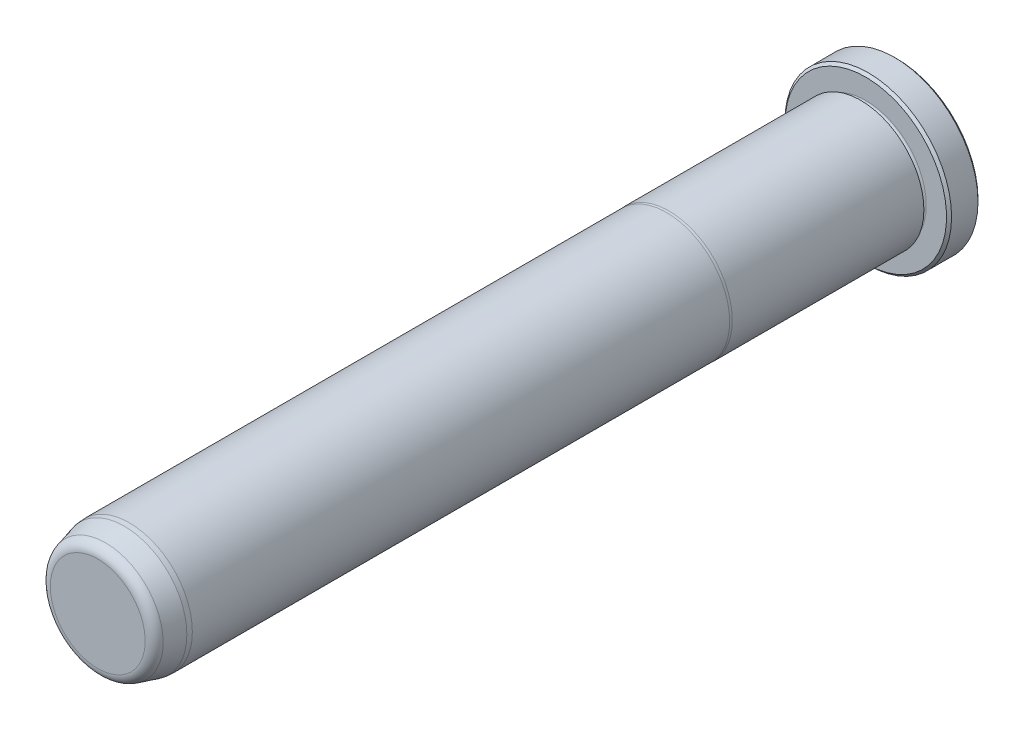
from build123d import *

# Parameters (mm, degrees)
FILLET6_R     = 1.5875
CHAMFER1_SIZE = 0.381


with BuildPart() as part:
    # Sketch1 → Revolve1 (revolve)
    with BuildSketch(Plane(origin=(0, 0, 0), x_dir=(0, 0, -1), z_dir=(1, 0, 0)), mode=Mode.PRIVATE) as revolve1_sk:
        with BuildLine():
            Line((0, 0), (0, 12.573))
            Line((0, 12.573), (-4.7498, 12.573))
            Line((-4.7498, 12.573), (-4.7498, 9.1313))
            ThreePointArc((-4.7498, 9.1313), (-5.1308, 8.7503), (-5.5118, 9.1313))
            Line((-5.5118, 9.1313), (-5.5118, 9.5377))
            Line((-5.5118, 9.5377), (-34.434763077, 9.5377))
            Line((-34.434763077, 9.5377), (-34.798, 9.5123))
            Line((-34.798, 9.5123), (-115.8875, 9.5123))
            Line((-115.8875, 9.5123), (-116.6495, 9.445633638))
            Line((-116.6495, 9.445633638), (-120.65, 8.373702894))
            Line((-120.65, 8.373702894), (-120.65, 0))
            Line((-120.65, 0), (0, 0))
        make_face()
    revolve(revolve1_sk.sketch.rotate(Axis((0, 0, 0), (0, 0, -1)), 90), axis=Axis((0, 0, 0), (0, 0, -1)))

    # Fillet6
    fillet6_edges = [part.edges().sort_by_distance(p)[0] for p in [
        (-8.373702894, 0, 120.65),
    ]]
    fillet(fillet6_edges, radius=FILLET6_R)

    # Chamfer1
    chamfer1_edges = [part.edges().sort_by_distance(p)[0] for p in [
        (-12.573, 0, 4.7498),
        (-12.573, 0, 0),
    ]]
    chamfer(chamfer1_edges, length=CHAMFER1_SIZE)


solid = part.part
